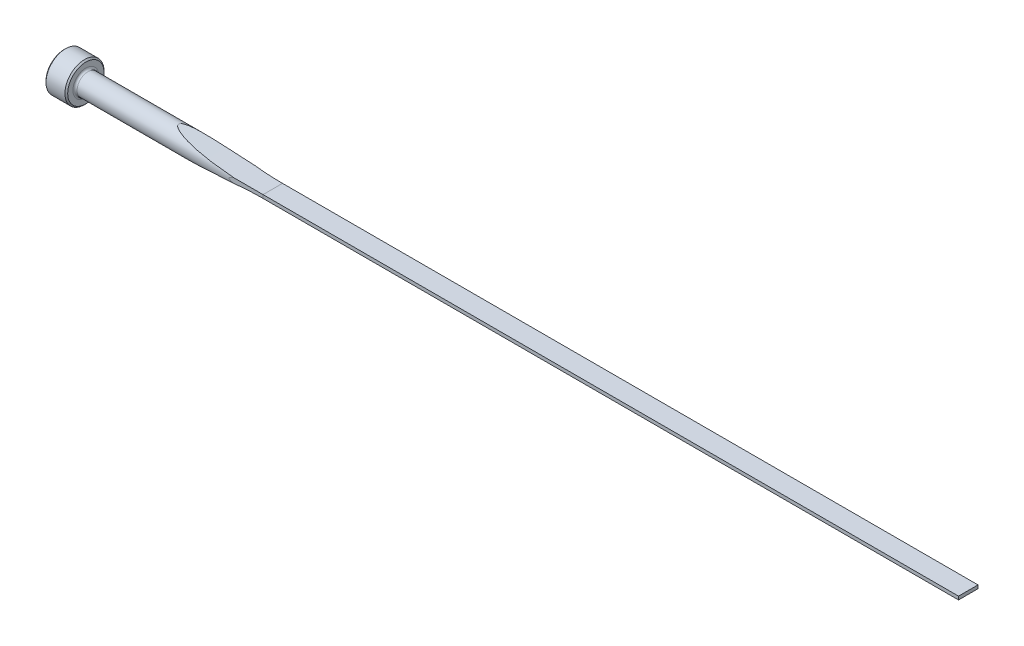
from build123d import *

# Parameters (mm, degrees)
CUT_EXTRUDE1_DEPTH = 166.177120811
CUT_EXTRUDE2_DEPTH = 166.177120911
FILLET1_R          = 0.381
CHAMFER1_SIZE      = 0.254


with BuildPart() as part:
    # Sketch1 → Revolve1 (revolve)
    with BuildSketch(Plane.XY, mode=Mode.PRIVATE) as revolve1_sk:
        Polygon((0, 0), (0, 3.5687), (3.9624, 3.5687), (3.9624, 1.9812), (165.1, 1.9812), (165.1, 0), align=None)
    revolve(revolve1_sk.sketch.rotate(Axis((0, 0, 0), (1, 0, 0)), 90), axis=Axis((0, 0, 0), (1, 0, 0)))

    # Sketch2 → Cut-Extrude1 (cut, symmetric)
    with BuildSketch(Plane.XY):
        with BuildLine():
            Line((165.1, 1.9812), (165.1, 0.3048))
            Line((165.1, 0.3048), (38.1, 0.3048))
            ThreePointArc((38.1, 0.3048), (29.467736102, 0.724892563), (20.917054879, 1.9812))
            Line((20.917054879, 1.9812), (165.1, 1.9812))
        make_face()
    cut_extrude1 = extrude(amount=CUT_EXTRUDE1_DEPTH, both=True, mode=Mode.SUBTRACT)

    # Mirror1: Cut-Extrude1 across plane
    add(cut_extrude1.mirror(Plane.ZX), mode=Mode.SUBTRACT)

    # Sketch3 → Cut-Extrude2 (cut, symmetric)
    with BuildSketch(Plane(origin=(0, 0, 0), x_dir=(1, 0, 0), z_dir=(0, 1, 0))):
        with BuildLine():
            Line((165.1, 1.9812), (165.1, 1.778))
            Line((165.1, 1.778), (38.1, 1.778))
            ThreePointArc((38.1, 1.778), (35.09463147, 1.828814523), (32.092698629, 1.9812))
            Line((32.092698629, 1.9812), (165.1, 1.9812))
        make_face()
    cut_extrude2 = extrude(amount=CUT_EXTRUDE2_DEPTH, both=True, mode=Mode.SUBTRACT)

    # Mirror2: Cut-Extrude2 across plane
    add(cut_extrude2.mirror(Plane.XY), mode=Mode.SUBTRACT)

    # Fillet1
    fillet1_edges = [part.edges().sort_by_distance(p)[0] for p in [
        (3.9624, 0, -1.9812),
    ]]
    fillet(fillet1_edges, radius=FILLET1_R)

    # Chamfer1
    chamfer1_edges = [part.edges().sort_by_distance(p)[0] for p in [
        (3.9624, 0, -3.5687),
        (0, 0, -3.5687),
    ]]
    chamfer(chamfer1_edges, length=CHAMFER1_SIZE)


solid = part.part
